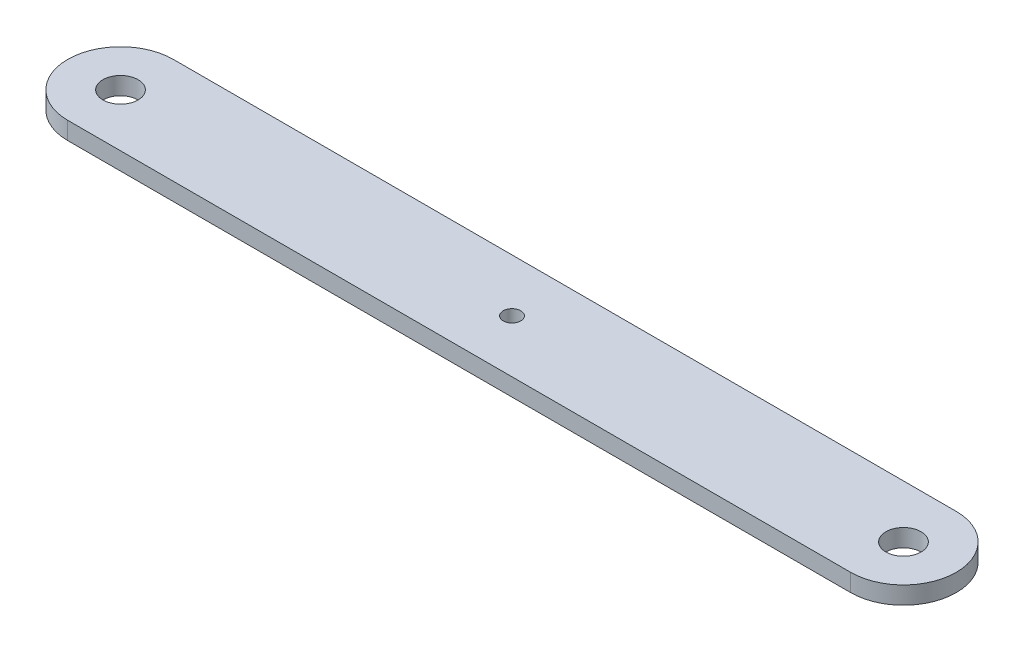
from build123d import *

# Parameters (mm, degrees)
BOSS_EXTRUDE1_DEPTH = 3.175
SKETCH2_R           = 6.35
SKETCH2_R_2         = 3.175
CUT_EXTRUDE1_DEPTH  = 162.590033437


with BuildPart() as part:
    # Sketch1 → Boss-Extrude1 (new, symmetric)
    with BuildSketch(Plane(origin=(0, 0, 0), x_dir=(1, 0, 0), z_dir=(0, 1, 0))):
        with BuildLine():
            Line((-141.2875, -19.05), (141.2875, -19.05))
            ThreePointArc((141.2875, -19.05), (160.3375, 0), (141.2875, 19.05))
            Line((141.2875, 19.05), (-141.2875, 19.05))
            ThreePointArc((-141.2875, 19.05), (-160.3375, 0), (-141.2875, -19.05))
        make_face()
    extrude(amount=BOSS_EXTRUDE1_DEPTH, both=True)

    # Sketch2 → Cut-Extrude1 (cut, through all)
    with BuildSketch(Plane(origin=(0, 3.175, 0), x_dir=(1, 0, 0), z_dir=(0, 1, 0))):
        with Locations(Location((-141.2875, 0, 0), (0, 0, 270))):
            Circle(SKETCH2_R)
        with Locations(Location((141.2875, 0, 0), (0, 0, 90))):
            Circle(SKETCH2_R)
        with Locations(Location((0, 0, 0), (0, 0, 270))):
            Circle(SKETCH2_R_2)
    extrude(amount=-CUT_EXTRUDE1_DEPTH, mode=Mode.SUBTRACT)


solid = part.part
